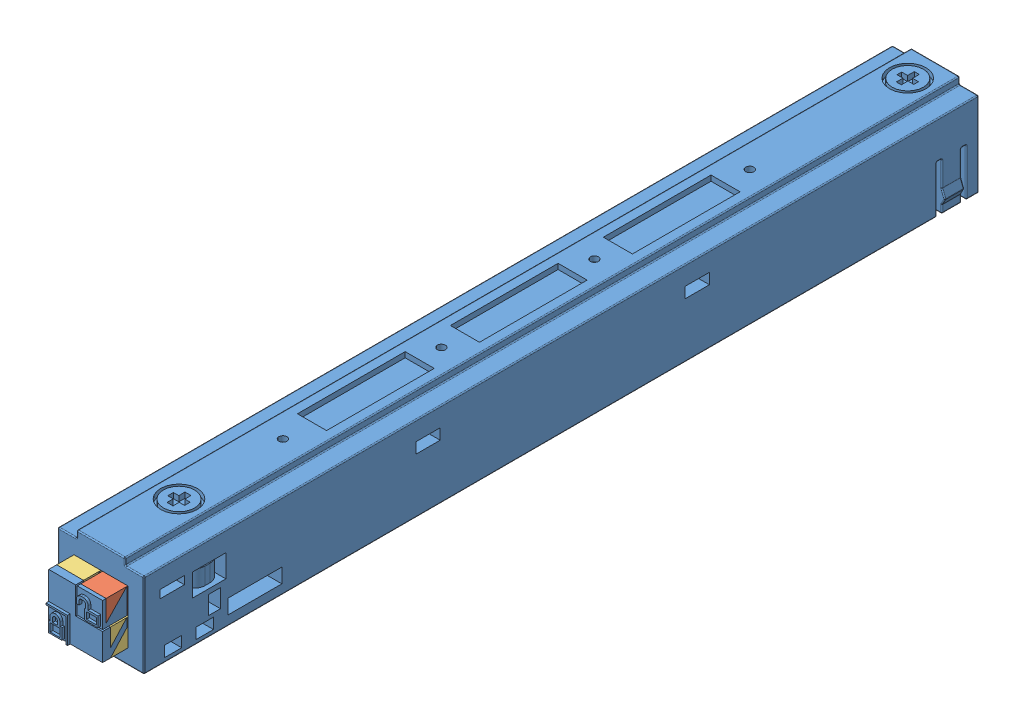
SolidWorks assembly Złożenie LVM-ADAPTER HIPER.SLDASM, configuration Domyślna (file format 14000). Lengths in mm.
Overall size (17.15 17 159.54).
3 component instances, 3 part files, 4 mates.
Components (placement in the parent):
- LVM-ADAPTER HIPER-1: LVM-ADAPTER HIPER.SLDPRT [Domyślna] at (-1.8032 -21.144 240.1) size (17.15 17 160.2)
- LVM-ADAPTER HIPER-otwarte-1: LVM-ADAPTER HIPER-otwarte.SLDPRT [Domyślna] at (-1.8032 -21.144 239.4445) size (4.7 4.7 5)
- LVM-ADAPTER HIPER-zamnkniete-1: LVM-ADAPTER HIPER-zamnkniete.SLDPRT [Domyślna] at (-1.8032 -21.144 238.6214) size (10 10 5)
Mates (geometry in assembly coordinates):
- Wspólnie1: coincident anti-aligned: plane of LVM-ADAPTER HIPER-1 through (-6.8032 4.3914 230.1) normal (0 -1 0); plane of LVM-ADAPTER HIPER-otwarte-1 through (-1.5018 4.3914 239.1445) normal (0 1 0)
- Wspólnie2: coincident anti-aligned: plane of LVM-ADAPTER HIPER-1 through (3.1968 4.3914 230.1) normal (-1 0 0); plane of LVM-ADAPTER HIPER-otwarte-1 through (3.1968 4.3914 239.1445) normal (1 0 0)
- Wspólnie3: coincident anti-aligned: plane of LVM-ADAPTER HIPER-1 through (-6.8032 4.3914 230.1) normal (1 0 0); plane of LVM-ADAPTER HIPER-zamnkniete-1 through (-6.8032 4.3914 238.3214) normal (-1 0 0)
- Wspólnie4: coincident anti-aligned: plane of LVM-ADAPTER HIPER-1 through (-6.8032 -5.6086 230.1) normal (0 1 0); plane of LVM-ADAPTER HIPER-zamnkniete-1 through (-6.8032 -5.6086 238.3214) normal (0 -1 0)
